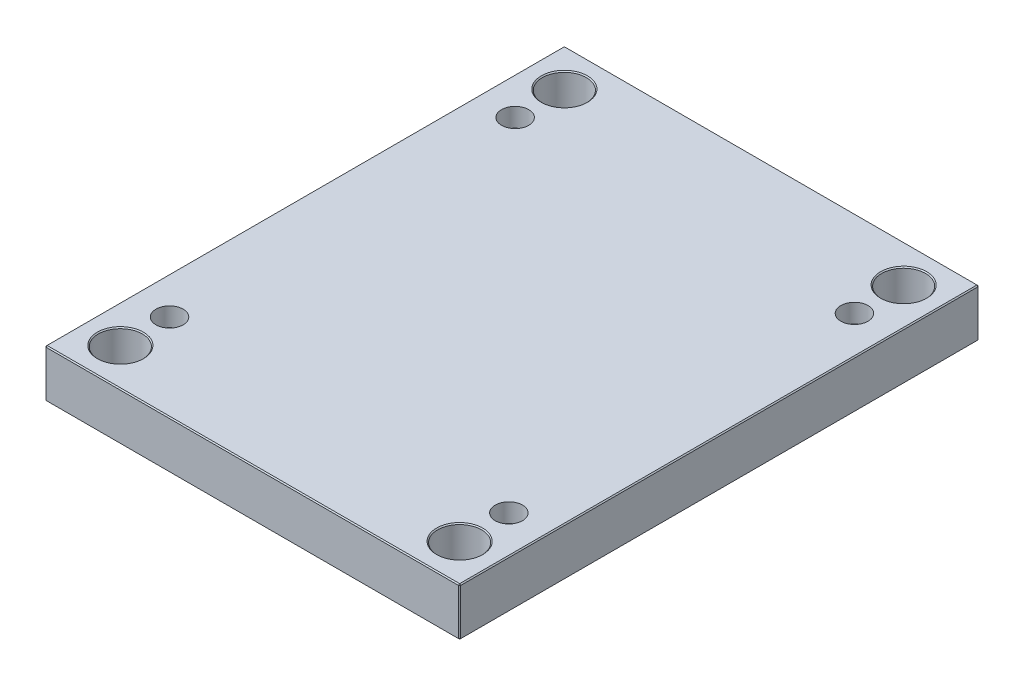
ISO-10303-21;
HEADER;
FILE_DESCRIPTION(('STEP AP214'),'2;1');
FILE_NAME('part.step','',(''),(''),'','','');
FILE_SCHEMA(('AUTOMOTIVE_DESIGN { 1 0 10303 214 1 1 1 1 }'));
ENDSEC;
DATA;
#1=APPLICATION_CONTEXT('core data for automotive mechanical design processes');
#2=APPLICATION_PROTOCOL_DEFINITION('international standard','automotive_design',2000,#1);
#3=PRODUCT_CONTEXT('',#1,'mechanical');
#4=PRODUCT('Part','Part','',(#3));
#5=PRODUCT_RELATED_PRODUCT_CATEGORY('part','',(#4));
#6=PRODUCT_DEFINITION_FORMATION('','',#4);
#7=PRODUCT_DEFINITION_CONTEXT('part definition',#1,'design');
#8=PRODUCT_DEFINITION('design','',#6,#7);
#9=PRODUCT_DEFINITION_SHAPE('','',#8);
#10=(LENGTH_UNIT() NAMED_UNIT(*) SI_UNIT(.MILLI.,.METRE.));
#11=(NAMED_UNIT(*) PLANE_ANGLE_UNIT() SI_UNIT($,.RADIAN.));
#12=(NAMED_UNIT(*) SI_UNIT($,.STERADIAN.) SOLID_ANGLE_UNIT());
#13=UNCERTAINTY_MEASURE_WITH_UNIT(LENGTH_MEASURE(1.E-05),#10,'distance_accuracy_value','');
#14=(GEOMETRIC_REPRESENTATION_CONTEXT(3) GLOBAL_UNCERTAINTY_ASSIGNED_CONTEXT((#13)) GLOBAL_UNIT_ASSIGNED_CONTEXT((#10,
#11,#12)) REPRESENTATION_CONTEXT('',''));
#15=CARTESIAN_POINT('',(0.,0.,0.));
#16=DIRECTION('',(0.,0.,1.));
#17=DIRECTION('',(1.,0.,0.));
#18=AXIS2_PLACEMENT_3D('',#15,#16,#17);
#19=CARTESIAN_POINT('',(-162.,0.,-165.));
#20=DIRECTION('',(0.,1.,0.));
#21=DIRECTION('',(0.,0.,1.));
#22=AXIS2_PLACEMENT_3D('',#19,#20,#21);
#23=CYLINDRICAL_SURFACE('',#22,8.);
#24=CARTESIAN_POINT('',(-162.,0.,-165.));
#25=DIRECTION('',(0.,1.,0.));
#26=DIRECTION('',(0.,0.,1.));
#27=AXIS2_PLACEMENT_3D('',#24,#25,#26);
#28=CIRCLE('',#27,8.);
#29=CARTESIAN_POINT('',(-162.,0.,-157.));
#30=VERTEX_POINT('',#29);
#31=EDGE_CURVE('E150',#30,#30,#28,.T.);
#32=ORIENTED_EDGE('',*,*,#31,.F.);
#33=EDGE_LOOP('',(#32));
#34=FACE_BOUND('',#33,.T.);
#35=CARTESIAN_POINT('',(-162.,28.,-165.));
#36=DIRECTION('',(0.,1.,0.));
#37=DIRECTION('',(0.,0.,1.));
#38=AXIS2_PLACEMENT_3D('',#35,#36,#37);
#39=CIRCLE('',#38,8.);
#40=CARTESIAN_POINT('',(-162.,28.,-157.));
#41=VERTEX_POINT('',#40);
#42=EDGE_CURVE('E20',#41,#41,#39,.F.);
#43=ORIENTED_EDGE('',*,*,#42,.F.);
#44=EDGE_LOOP('',(#43));
#45=FACE_BOUND('',#44,.T.);
#46=ADVANCED_FACE('F16',(#34,#45),#23,.F.);
#47=CARTESIAN_POINT('',(162.,0.,-165.));
#48=DIRECTION('',(0.,1.,0.));
#49=DIRECTION('',(0.,0.,1.));
#50=AXIS2_PLACEMENT_3D('',#47,#48,#49);
#51=CYLINDRICAL_SURFACE('',#50,8.);
#52=CARTESIAN_POINT('',(162.,0.,-165.));
#53=DIRECTION('',(0.,1.,0.));
#54=DIRECTION('',(0.,0.,1.));
#55=AXIS2_PLACEMENT_3D('',#52,#53,#54);
#56=CIRCLE('',#55,8.);
#57=CARTESIAN_POINT('',(162.,0.,-157.));
#58=VERTEX_POINT('',#57);
#59=EDGE_CURVE('E307',#58,#58,#56,.T.);
#60=ORIENTED_EDGE('',*,*,#59,.F.);
#61=EDGE_LOOP('',(#60));
#62=FACE_BOUND('',#61,.T.);
#63=CARTESIAN_POINT('',(162.,28.,-165.));
#64=DIRECTION('',(0.,1.,0.));
#65=DIRECTION('',(0.,0.,1.));
#66=AXIS2_PLACEMENT_3D('',#63,#64,#65);
#67=CIRCLE('',#66,8.);
#68=CARTESIAN_POINT('',(162.,28.,-157.));
#69=VERTEX_POINT('',#68);
#70=EDGE_CURVE('E294',#69,#69,#67,.F.);
#71=ORIENTED_EDGE('',*,*,#70,.F.);
#72=EDGE_LOOP('',(#71));
#73=FACE_BOUND('',#72,.T.);
#74=ADVANCED_FACE('F473',(#62,#73),#51,.F.);
#75=CARTESIAN_POINT('',(162.,0.,165.));
#76=DIRECTION('',(0.,1.,0.));
#77=DIRECTION('',(0.,0.,1.));
#78=AXIS2_PLACEMENT_3D('',#75,#76,#77);
#79=CYLINDRICAL_SURFACE('',#78,8.);
#80=CARTESIAN_POINT('',(162.,0.,165.));
#81=DIRECTION('',(0.,1.,0.));
#82=DIRECTION('',(0.,0.,1.));
#83=AXIS2_PLACEMENT_3D('',#80,#81,#82);
#84=CIRCLE('',#83,8.);
#85=CARTESIAN_POINT('',(162.,0.,173.));
#86=VERTEX_POINT('',#85);
#87=EDGE_CURVE('E303',#86,#86,#84,.T.);
#88=ORIENTED_EDGE('',*,*,#87,.F.);
#89=EDGE_LOOP('',(#88));
#90=FACE_BOUND('',#89,.T.);
#91=CARTESIAN_POINT('',(162.,28.,165.));
#92=DIRECTION('',(0.,1.,0.));
#93=DIRECTION('',(0.,0.,1.));
#94=AXIS2_PLACEMENT_3D('',#91,#92,#93);
#95=CIRCLE('',#94,8.);
#96=CARTESIAN_POINT('',(162.,28.,173.));
#97=VERTEX_POINT('',#96);
#98=EDGE_CURVE('E291',#97,#97,#95,.F.);
#99=ORIENTED_EDGE('',*,*,#98,.F.);
#100=EDGE_LOOP('',(#99));
#101=FACE_BOUND('',#100,.T.);
#102=ADVANCED_FACE('F480',(#90,#101),#79,.F.);
#103=CARTESIAN_POINT('',(-162.,0.,165.));
#104=DIRECTION('',(0.,1.,0.));
#105=DIRECTION('',(0.,0.,1.));
#106=AXIS2_PLACEMENT_3D('',#103,#104,#105);
#107=CYLINDRICAL_SURFACE('',#106,8.);
#108=CARTESIAN_POINT('',(-162.,0.,165.));
#109=DIRECTION('',(0.,1.,0.));
#110=DIRECTION('',(0.,0.,1.));
#111=AXIS2_PLACEMENT_3D('',#108,#109,#110);
#112=CIRCLE('',#111,8.);
#113=CARTESIAN_POINT('',(-162.,0.,173.));
#114=VERTEX_POINT('',#113);
#115=EDGE_CURVE('E299',#114,#114,#112,.T.);
#116=ORIENTED_EDGE('',*,*,#115,.F.);
#117=EDGE_LOOP('',(#116));
#118=FACE_BOUND('',#117,.T.);
#119=CARTESIAN_POINT('',(-162.,28.,165.));
#120=DIRECTION('',(0.,1.,0.));
#121=DIRECTION('',(0.,0.,1.));
#122=AXIS2_PLACEMENT_3D('',#119,#120,#121);
#123=CIRCLE('',#122,8.);
#124=CARTESIAN_POINT('',(-162.,28.,173.));
#125=VERTEX_POINT('',#124);
#126=EDGE_CURVE('E288',#125,#125,#123,.F.);
#127=ORIENTED_EDGE('',*,*,#126,.F.);
#128=EDGE_LOOP('',(#127));
#129=FACE_BOUND('',#128,.T.);
#130=ADVANCED_FACE('F485',(#118,#129),#107,.F.);
#131=CARTESIAN_POINT('',(-198.,46.,248.));
#132=DIRECTION('',(1.,0.,0.));
#133=DIRECTION('',(0.,0.,-1.));
#134=AXIS2_PLACEMENT_3D('',#131,#132,#133);
#135=PLANE('',#134);
#136=DIRECTION('',(0.,-1.,0.));
#137=VECTOR('',#136,1.);
#138=CARTESIAN_POINT('',(-198.,46.,-247.));
#139=LINE('',#138,#137);
#140=CARTESIAN_POINT('',(-198.,45.,-247.));
#141=VERTEX_POINT('',#140);
#142=CARTESIAN_POINT('',(-198.,1.,-247.));
#143=VERTEX_POINT('',#142);
#144=EDGE_CURVE('E118',#141,#143,#139,.T.);
#145=ORIENTED_EDGE('',*,*,#144,.T.);
#146=DIRECTION('',(0.,0.,1.));
#147=VECTOR('',#146,1.);
#148=CARTESIAN_POINT('',(-198.,1.,248.));
#149=LINE('',#148,#147);
#150=CARTESIAN_POINT('',(-198.,1.,247.));
#151=VERTEX_POINT('',#150);
#152=EDGE_CURVE('E114',#143,#151,#149,.T.);
#153=ORIENTED_EDGE('',*,*,#152,.T.);
#154=DIRECTION('',(0.,1.,0.));
#155=VECTOR('',#154,1.);
#156=CARTESIAN_POINT('',(-198.,46.,247.));
#157=LINE('',#156,#155);
#158=CARTESIAN_POINT('',(-198.,45.,247.));
#159=VERTEX_POINT('',#158);
#160=EDGE_CURVE('E106',#151,#159,#157,.T.);
#161=ORIENTED_EDGE('',*,*,#160,.T.);
#162=DIRECTION('',(0.,0.,-1.));
#163=VECTOR('',#162,1.);
#164=CARTESIAN_POINT('',(-198.,45.,-248.));
#165=LINE('',#164,#163);
#166=EDGE_CURVE('E111',#159,#141,#165,.T.);
#167=ORIENTED_EDGE('',*,*,#166,.T.);
#168=EDGE_LOOP('',(#145,#153,#161,#167));
#169=FACE_BOUND('',#168,.T.);
#170=ADVANCED_FACE('F109',(#169),#135,.F.);
#171=CARTESIAN_POINT('',(198.,46.,248.));
#172=DIRECTION('',(0.,0.,-1.));
#173=DIRECTION('',(-1.,0.,0.));
#174=AXIS2_PLACEMENT_3D('',#171,#172,#173);
#175=PLANE('',#174);
#176=DIRECTION('',(-1.,0.,0.));
#177=VECTOR('',#176,1.);
#178=CARTESIAN_POINT('',(-198.,45.,248.));
#179=LINE('',#178,#177);
#180=CARTESIAN_POINT('',(197.,45.,248.));
#181=VERTEX_POINT('',#180);
#182=CARTESIAN_POINT('',(-197.,45.,248.));
#183=VERTEX_POINT('',#182);
#184=EDGE_CURVE('E173',#181,#183,#179,.T.);
#185=ORIENTED_EDGE('',*,*,#184,.T.);
#186=DIRECTION('',(0.,-1.,0.));
#187=VECTOR('',#186,1.);
#188=CARTESIAN_POINT('',(-197.,46.,248.));
#189=LINE('',#188,#187);
#190=CARTESIAN_POINT('',(-197.,1.,248.));
#191=VERTEX_POINT('',#190);
#192=EDGE_CURVE('E126',#183,#191,#189,.T.);
#193=ORIENTED_EDGE('',*,*,#192,.T.);
#194=DIRECTION('',(1.,0.,0.));
#195=VECTOR('',#194,1.);
#196=CARTESIAN_POINT('',(198.,1.,248.));
#197=LINE('',#196,#195);
#198=CARTESIAN_POINT('',(197.,1.,248.));
#199=VERTEX_POINT('',#198);
#200=EDGE_CURVE('E177',#191,#199,#197,.T.);
#201=ORIENTED_EDGE('',*,*,#200,.T.);
#202=DIRECTION('',(0.,1.,0.));
#203=VECTOR('',#202,1.);
#204=CARTESIAN_POINT('',(197.,46.,248.));
#205=LINE('',#204,#203);
#206=EDGE_CURVE('E175',#199,#181,#205,.T.);
#207=ORIENTED_EDGE('',*,*,#206,.T.);
#208=EDGE_LOOP('',(#185,#193,#201,#207));
#209=FACE_BOUND('',#208,.T.);
#210=ADVANCED_FACE('F438',(#209),#175,.F.);
#211=CARTESIAN_POINT('',(198.,46.,248.));
#212=DIRECTION('',(-1.,0.,0.));
#213=DIRECTION('',(0.,0.,1.));
#214=AXIS2_PLACEMENT_3D('',#211,#212,#213);
#215=PLANE('',#214);
#216=DIRECTION('',(0.,0.,-1.));
#217=VECTOR('',#216,1.);
#218=CARTESIAN_POINT('',(198.,1.,248.));
#219=LINE('',#218,#217);
#220=CARTESIAN_POINT('',(198.,1.,247.));
#221=VERTEX_POINT('',#220);
#222=CARTESIAN_POINT('',(198.,1.,-247.));
#223=VERTEX_POINT('',#222);
#224=EDGE_CURVE('E168',#221,#223,#219,.T.);
#225=ORIENTED_EDGE('',*,*,#224,.T.);
#226=DIRECTION('',(0.,1.,0.));
#227=VECTOR('',#226,1.);
#228=CARTESIAN_POINT('',(198.,46.,-247.));
#229=LINE('',#228,#227);
#230=CARTESIAN_POINT('',(198.,45.,-247.));
#231=VERTEX_POINT('',#230);
#232=EDGE_CURVE('E170',#223,#231,#229,.T.);
#233=ORIENTED_EDGE('',*,*,#232,.T.);
#234=DIRECTION('',(0.,0.,1.));
#235=VECTOR('',#234,1.);
#236=CARTESIAN_POINT('',(198.,45.,248.));
#237=LINE('',#236,#235);
#238=CARTESIAN_POINT('',(198.,45.,247.));
#239=VERTEX_POINT('',#238);
#240=EDGE_CURVE('E164',#231,#239,#237,.T.);
#241=ORIENTED_EDGE('',*,*,#240,.T.);
#242=DIRECTION('',(0.,-1.,0.));
#243=VECTOR('',#242,1.);
#244=CARTESIAN_POINT('',(198.,46.,247.));
#245=LINE('',#244,#243);
#246=EDGE_CURVE('E166',#239,#221,#245,.T.);
#247=ORIENTED_EDGE('',*,*,#246,.T.);
#248=EDGE_LOOP('',(#225,#233,#241,#247));
#249=FACE_BOUND('',#248,.T.);
#250=ADVANCED_FACE('F431',(#249),#215,.F.);
#251=CARTESIAN_POINT('',(198.,46.,-248.));
#252=DIRECTION('',(0.,0.,1.));
#253=DIRECTION('',(1.,0.,0.));
#254=AXIS2_PLACEMENT_3D('',#251,#252,#253);
#255=PLANE('',#254);
#256=DIRECTION('',(0.,-1.,0.));
#257=VECTOR('',#256,1.);
#258=CARTESIAN_POINT('',(197.,46.,-248.));
#259=LINE('',#258,#257);
#260=CARTESIAN_POINT('',(197.,45.,-248.));
#261=VERTEX_POINT('',#260);
#262=CARTESIAN_POINT('',(197.,1.,-248.));
#263=VERTEX_POINT('',#262);
#264=EDGE_CURVE('E157',#261,#263,#259,.T.);
#265=ORIENTED_EDGE('',*,*,#264,.T.);
#266=DIRECTION('',(-1.,0.,0.));
#267=VECTOR('',#266,1.);
#268=CARTESIAN_POINT('',(198.,1.,-248.));
#269=LINE('',#268,#267);
#270=CARTESIAN_POINT('',(-197.,1.,-248.));
#271=VERTEX_POINT('',#270);
#272=EDGE_CURVE('E162',#263,#271,#269,.T.);
#273=ORIENTED_EDGE('',*,*,#272,.T.);
#274=DIRECTION('',(0.,1.,0.));
#275=VECTOR('',#274,1.);
#276=CARTESIAN_POINT('',(-197.,46.,-248.));
#277=LINE('',#276,#275);
#278=CARTESIAN_POINT('',(-197.,45.,-248.));
#279=VERTEX_POINT('',#278);
#280=EDGE_CURVE('E159',#271,#279,#277,.T.);
#281=ORIENTED_EDGE('',*,*,#280,.T.);
#282=DIRECTION('',(1.,0.,0.));
#283=VECTOR('',#282,1.);
#284=CARTESIAN_POINT('',(198.,45.,-248.));
#285=LINE('',#284,#283);
#286=EDGE_CURVE('E155',#279,#261,#285,.T.);
#287=ORIENTED_EDGE('',*,*,#286,.T.);
#288=EDGE_LOOP('',(#265,#273,#281,#287));
#289=FACE_BOUND('',#288,.T.);
#290=ADVANCED_FACE('F349',(#289),#255,.F.);
#291=CARTESIAN_POINT('',(0.,46.,0.));
#292=DIRECTION('',(0.,1.,0.));
#293=DIRECTION('',(0.,0.,1.));
#294=AXIS2_PLACEMENT_3D('',#291,#292,#293);
#295=PLANE('',#294);
#296=CARTESIAN_POINT('',(-162.,46.,165.));
#297=DIRECTION('',(0.,1.,0.));
#298=DIRECTION('',(0.,0.,1.));
#299=AXIS2_PLACEMENT_3D('',#296,#297,#298);
#300=CIRCLE('',#299,13.);
#301=CARTESIAN_POINT('',(-162.,46.,178.));
#302=VERTEX_POINT('',#301);
#303=EDGE_CURVE('E318',#302,#302,#300,.T.);
#304=ORIENTED_EDGE('',*,*,#303,.F.);
#305=EDGE_LOOP('',(#304));
#306=FACE_BOUND('',#305,.T.);
#307=CARTESIAN_POINT('',(162.,46.,165.));
#308=DIRECTION('',(0.,1.,0.));
#309=DIRECTION('',(0.,0.,1.));
#310=AXIS2_PLACEMENT_3D('',#307,#308,#309);
#311=CIRCLE('',#310,13.);
#312=CARTESIAN_POINT('',(162.,46.,178.));
#313=VERTEX_POINT('',#312);
#314=EDGE_CURVE('E324',#313,#313,#311,.T.);
#315=ORIENTED_EDGE('',*,*,#314,.F.);
#316=EDGE_LOOP('',(#315));
#317=FACE_BOUND('',#316,.T.);
#318=CARTESIAN_POINT('',(162.,46.,-165.));
#319=DIRECTION('',(0.,1.,0.));
#320=DIRECTION('',(0.,0.,1.));
#321=AXIS2_PLACEMENT_3D('',#318,#319,#320);
#322=CIRCLE('',#321,13.);
#323=CARTESIAN_POINT('',(162.,46.,-152.));
#324=VERTEX_POINT('',#323);
#325=EDGE_CURVE('E330',#324,#324,#322,.T.);
#326=ORIENTED_EDGE('',*,*,#325,.F.);
#327=EDGE_LOOP('',(#326));
#328=FACE_BOUND('',#327,.T.);
#329=CARTESIAN_POINT('',(-162.,46.,-165.));
#330=DIRECTION('',(0.,1.,0.));
#331=DIRECTION('',(0.,0.,1.));
#332=AXIS2_PLACEMENT_3D('',#329,#330,#331);
#333=CIRCLE('',#332,13.);
#334=CARTESIAN_POINT('',(-162.,46.,-152.));
#335=VERTEX_POINT('',#334);
#336=EDGE_CURVE('E312',#335,#335,#333,.T.);
#337=ORIENTED_EDGE('',*,*,#336,.F.);
#338=EDGE_LOOP('',(#337));
#339=FACE_BOUND('',#338,.T.);
#340=CARTESIAN_POINT('',(-162.,46.,212.));
#341=DIRECTION('',(0.,1.,0.));
#342=DIRECTION('',(0.,0.,1.));
#343=AXIS2_PLACEMENT_3D('',#340,#341,#342);
#344=CIRCLE('',#343,22.);
#345=CARTESIAN_POINT('',(-162.,46.,234.));
#346=VERTEX_POINT('',#345);
#347=EDGE_CURVE('E259',#346,#346,#344,.F.);
#348=ORIENTED_EDGE('',*,*,#347,.T.);
#349=EDGE_LOOP('',(#348));
#350=FACE_BOUND('',#349,.T.);
#351=CARTESIAN_POINT('',(162.,46.,212.));
#352=DIRECTION('',(0.,1.,0.));
#353=DIRECTION('',(0.,0.,1.));
#354=AXIS2_PLACEMENT_3D('',#351,#352,#353);
#355=CIRCLE('',#354,22.);
#356=CARTESIAN_POINT('',(162.,46.,234.));
#357=VERTEX_POINT('',#356);
#358=EDGE_CURVE('E256',#357,#357,#355,.F.);
#359=ORIENTED_EDGE('',*,*,#358,.T.);
#360=EDGE_LOOP('',(#359));
#361=FACE_BOUND('',#360,.T.);
#362=CARTESIAN_POINT('',(162.,46.,-212.));
#363=DIRECTION('',(0.,1.,0.));
#364=DIRECTION('',(0.,0.,1.));
#365=AXIS2_PLACEMENT_3D('',#362,#363,#364);
#366=CIRCLE('',#365,22.);
#367=CARTESIAN_POINT('',(162.,46.,-190.));
#368=VERTEX_POINT('',#367);
#369=EDGE_CURVE('E253',#368,#368,#366,.F.);
#370=ORIENTED_EDGE('',*,*,#369,.T.);
#371=EDGE_LOOP('',(#370));
#372=FACE_BOUND('',#371,.T.);
#373=CARTESIAN_POINT('',(-162.,46.,-212.));
#374=DIRECTION('',(0.,1.,0.));
#375=DIRECTION('',(0.,0.,1.));
#376=AXIS2_PLACEMENT_3D('',#373,#374,#375);
#377=CIRCLE('',#376,22.);
#378=CARTESIAN_POINT('',(-162.,46.,-190.));
#379=VERTEX_POINT('',#378);
#380=EDGE_CURVE('E250',#379,#379,#377,.F.);
#381=ORIENTED_EDGE('',*,*,#380,.T.);
#382=EDGE_LOOP('',(#381));
#383=FACE_BOUND('',#382,.T.);
#384=DIRECTION('',(0.,0.,-1.));
#385=VECTOR('',#384,1.);
#386=CARTESIAN_POINT('',(197.,46.,-248.));
#387=LINE('',#386,#385);
#388=CARTESIAN_POINT('',(197.,46.,247.));
#389=VERTEX_POINT('',#388);
#390=CARTESIAN_POINT('',(197.,46.,-247.));
#391=VERTEX_POINT('',#390);
#392=EDGE_CURVE('E33',#389,#391,#387,.T.);
#393=ORIENTED_EDGE('',*,*,#392,.T.);
#394=DIRECTION('',(-1.,0.,0.));
#395=VECTOR('',#394,1.);
#396=CARTESIAN_POINT('',(-198.,46.,-247.));
#397=LINE('',#396,#395);
#398=CARTESIAN_POINT('',(-197.,46.,-247.));
#399=VERTEX_POINT('',#398);
#400=EDGE_CURVE('E193',#391,#399,#397,.T.);
#401=ORIENTED_EDGE('',*,*,#400,.T.);
#402=DIRECTION('',(0.,0.,1.));
#403=VECTOR('',#402,1.);
#404=CARTESIAN_POINT('',(-197.,46.,248.));
#405=LINE('',#404,#403);
#406=CARTESIAN_POINT('',(-197.,46.,247.));
#407=VERTEX_POINT('',#406);
#408=EDGE_CURVE('E189',#399,#407,#405,.T.);
#409=ORIENTED_EDGE('',*,*,#408,.T.);
#410=DIRECTION('',(1.,0.,0.));
#411=VECTOR('',#410,1.);
#412=CARTESIAN_POINT('',(198.,46.,247.));
#413=LINE('',#412,#411);
#414=EDGE_CURVE('E38',#407,#389,#413,.T.);
#415=ORIENTED_EDGE('',*,*,#414,.T.);
#416=EDGE_LOOP('',(#393,#401,#409,#415));
#417=FACE_BOUND('',#416,.T.);
#418=ADVANCED_FACE('F345',(#306,#317,#328,#339,#350,#361,#372,#383,#417),#295,.T.);
#419=CARTESIAN_POINT('',(0.,0.,0.));
#420=DIRECTION('',(0.,1.,0.));
#421=DIRECTION('',(0.,0.,1.));
#422=AXIS2_PLACEMENT_3D('',#419,#420,#421);
#423=PLANE('',#422);
#424=CARTESIAN_POINT('',(-162.,0.,212.));
#425=DIRECTION('',(0.,1.,0.));
#426=DIRECTION('',(0.,0.,1.));
#427=AXIS2_PLACEMENT_3D('',#424,#425,#426);
#428=CIRCLE('',#427,22.);
#429=CARTESIAN_POINT('',(-162.,0.,234.));
#430=VERTEX_POINT('',#429);
#431=EDGE_CURVE('E271',#430,#430,#428,.T.);
#432=ORIENTED_EDGE('',*,*,#431,.T.);
#433=EDGE_LOOP('',(#432));
#434=FACE_BOUND('',#433,.T.);
#435=CARTESIAN_POINT('',(162.,0.,212.));
#436=DIRECTION('',(0.,1.,0.));
#437=DIRECTION('',(0.,0.,1.));
#438=AXIS2_PLACEMENT_3D('',#435,#436,#437);
#439=CIRCLE('',#438,22.);
#440=CARTESIAN_POINT('',(162.,0.,234.));
#441=VERTEX_POINT('',#440);
#442=EDGE_CURVE('E268',#441,#441,#439,.T.);
#443=ORIENTED_EDGE('',*,*,#442,.T.);
#444=EDGE_LOOP('',(#443));
#445=FACE_BOUND('',#444,.T.);
#446=CARTESIAN_POINT('',(162.,0.,-212.));
#447=DIRECTION('',(0.,1.,0.));
#448=DIRECTION('',(0.,0.,1.));
#449=AXIS2_PLACEMENT_3D('',#446,#447,#448);
#450=CIRCLE('',#449,22.);
#451=CARTESIAN_POINT('',(162.,0.,-190.));
#452=VERTEX_POINT('',#451);
#453=EDGE_CURVE('E265',#452,#452,#450,.T.);
#454=ORIENTED_EDGE('',*,*,#453,.T.);
#455=EDGE_LOOP('',(#454));
#456=FACE_BOUND('',#455,.T.);
#457=CARTESIAN_POINT('',(-162.,0.,-212.));
#458=DIRECTION('',(0.,1.,0.));
#459=DIRECTION('',(0.,0.,1.));
#460=AXIS2_PLACEMENT_3D('',#457,#458,#459);
#461=CIRCLE('',#460,22.);
#462=CARTESIAN_POINT('',(-162.,0.,-190.));
#463=VERTEX_POINT('',#462);
#464=EDGE_CURVE('E262',#463,#463,#461,.T.);
#465=ORIENTED_EDGE('',*,*,#464,.T.);
#466=EDGE_LOOP('',(#465));
#467=FACE_BOUND('',#466,.T.);
#468=ORIENTED_EDGE('',*,*,#115,.T.);
#469=EDGE_LOOP('',(#468));
#470=FACE_BOUND('',#469,.T.);
#471=ORIENTED_EDGE('',*,*,#87,.T.);
#472=EDGE_LOOP('',(#471));
#473=FACE_BOUND('',#472,.T.);
#474=ORIENTED_EDGE('',*,*,#59,.T.);
#475=EDGE_LOOP('',(#474));
#476=FACE_BOUND('',#475,.T.);
#477=ORIENTED_EDGE('',*,*,#31,.T.);
#478=EDGE_LOOP('',(#477));
#479=FACE_BOUND('',#478,.T.);
#480=DIRECTION('',(0.,0.,1.));
#481=VECTOR('',#480,1.);
#482=CARTESIAN_POINT('',(197.,0.,0.));
#483=LINE('',#482,#481);
#484=CARTESIAN_POINT('',(197.,0.,-247.));
#485=VERTEX_POINT('',#484);
#486=CARTESIAN_POINT('',(197.,0.,247.));
#487=VERTEX_POINT('',#486);
#488=EDGE_CURVE('E180',#485,#487,#483,.T.);
#489=ORIENTED_EDGE('',*,*,#488,.T.);
#490=DIRECTION('',(-1.,0.,0.));
#491=VECTOR('',#490,1.);
#492=CARTESIAN_POINT('',(0.,0.,247.));
#493=LINE('',#492,#491);
#494=CARTESIAN_POINT('',(-197.,0.,247.));
#495=VERTEX_POINT('',#494);
#496=EDGE_CURVE('E186',#487,#495,#493,.T.);
#497=ORIENTED_EDGE('',*,*,#496,.T.);
#498=DIRECTION('',(0.,0.,-1.));
#499=VECTOR('',#498,1.);
#500=CARTESIAN_POINT('',(-197.,0.,0.));
#501=LINE('',#500,#499);
#502=CARTESIAN_POINT('',(-197.,0.,-247.));
#503=VERTEX_POINT('',#502);
#504=EDGE_CURVE('E184',#495,#503,#501,.T.);
#505=ORIENTED_EDGE('',*,*,#504,.T.);
#506=DIRECTION('',(1.,0.,0.));
#507=VECTOR('',#506,1.);
#508=CARTESIAN_POINT('',(0.,0.,-247.));
#509=LINE('',#508,#507);
#510=EDGE_CURVE('E182',#503,#485,#509,.T.);
#511=ORIENTED_EDGE('',*,*,#510,.T.);
#512=EDGE_LOOP('',(#489,#497,#505,#511));
#513=FACE_BOUND('',#512,.T.);
#514=ADVANCED_FACE('F348',(#434,#445,#456,#467,#470,#473,#476,#479,#513),#423,.F.);
#515=CARTESIAN_POINT('',(198.,46.,247.));
#516=DIRECTION('',(-0.707106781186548,0.,-0.707106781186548));
#517=DIRECTION('',(0.,-1.,0.));
#518=AXIS2_PLACEMENT_3D('',#515,#516,#517);
#519=PLANE('',#518);
#520=DIRECTION('',(-0.707106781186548,0.,0.707106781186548));
#521=VECTOR('',#520,1.);
#522=CARTESIAN_POINT('',(197.,45.,248.));
#523=LINE('',#522,#521);
#524=EDGE_CURVE('E144',#181,#239,#523,.F.);
#525=ORIENTED_EDGE('',*,*,#524,.F.);
#526=ORIENTED_EDGE('',*,*,#206,.F.);
#527=DIRECTION('',(0.707106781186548,0.,-0.707106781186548));
#528=VECTOR('',#527,1.);
#529=CARTESIAN_POINT('',(197.,1.,248.));
#530=LINE('',#529,#528);
#531=EDGE_CURVE('E147',#221,#199,#530,.F.);
#532=ORIENTED_EDGE('',*,*,#531,.F.);
#533=ORIENTED_EDGE('',*,*,#246,.F.);
#534=EDGE_LOOP('',(#525,#526,#532,#533));
#535=FACE_BOUND('',#534,.T.);
#536=ADVANCED_FACE('F382',(#535),#519,.F.);
#537=CARTESIAN_POINT('',(197.,45.,248.));
#538=DIRECTION('',(0.577350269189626,0.577350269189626,0.577350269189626));
#539=DIRECTION('',(0.707106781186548,0.,-0.707106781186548));
#540=AXIS2_PLACEMENT_3D('',#537,#538,#539);
#541=PLANE('',#540);
#542=DIRECTION('',(0.,-0.707106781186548,0.707106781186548));
#543=VECTOR('',#542,1.);
#544=CARTESIAN_POINT('',(197.,45.,248.));
#545=LINE('',#544,#543);
#546=EDGE_CURVE('E238',#181,#389,#545,.F.);
#547=ORIENTED_EDGE('',*,*,#546,.F.);
#548=ORIENTED_EDGE('',*,*,#524,.T.);
#549=DIRECTION('',(-0.707106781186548,0.707106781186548,0.));
#550=VECTOR('',#549,1.);
#551=CARTESIAN_POINT('',(197.5,45.5,247.));
#552=LINE('',#551,#550);
#553=EDGE_CURVE('E240',#389,#239,#552,.F.);
#554=ORIENTED_EDGE('',*,*,#553,.F.);
#555=EDGE_LOOP('',(#547,#548,#554));
#556=FACE_BOUND('',#555,.T.);
#557=ADVANCED_FACE('F444',(#556),#541,.T.);
#558=CARTESIAN_POINT('',(197.,1.,248.));
#559=DIRECTION('',(0.577350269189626,-0.577350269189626,0.577350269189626));
#560=DIRECTION('',(0.707106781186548,0.,-0.707106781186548));
#561=AXIS2_PLACEMENT_3D('',#558,#559,#560);
#562=PLANE('',#561);
#563=DIRECTION('',(-0.707106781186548,-0.707106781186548,0.));
#564=VECTOR('',#563,1.);
#565=CARTESIAN_POINT('',(197.5,0.5,247.));
#566=LINE('',#565,#564);
#567=EDGE_CURVE('E232',#221,#487,#566,.T.);
#568=ORIENTED_EDGE('',*,*,#567,.F.);
#569=ORIENTED_EDGE('',*,*,#531,.T.);
#570=DIRECTION('',(0.,0.707106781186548,0.707106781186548));
#571=VECTOR('',#570,1.);
#572=CARTESIAN_POINT('',(197.,1.,248.));
#573=LINE('',#572,#571);
#574=EDGE_CURVE('E235',#487,#199,#573,.T.);
#575=ORIENTED_EDGE('',*,*,#574,.F.);
#576=EDGE_LOOP('',(#568,#569,#575));
#577=FACE_BOUND('',#576,.T.);
#578=ADVANCED_FACE('F403',(#577),#562,.T.);
#579=CARTESIAN_POINT('',(197.,46.,0.));
#580=DIRECTION('',(0.707106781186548,0.707106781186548,0.));
#581=DIRECTION('',(0.,0.,1.));
#582=AXIS2_PLACEMENT_3D('',#579,#580,#581);
#583=PLANE('',#582);
#584=ORIENTED_EDGE('',*,*,#553,.T.);
#585=ORIENTED_EDGE('',*,*,#240,.F.);
#586=DIRECTION('',(0.707106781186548,-0.707106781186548,0.));
#587=VECTOR('',#586,1.);
#588=CARTESIAN_POINT('',(198.,45.,-247.));
#589=LINE('',#588,#587);
#590=EDGE_CURVE('E227',#391,#231,#589,.T.);
#591=ORIENTED_EDGE('',*,*,#590,.F.);
#592=ORIENTED_EDGE('',*,*,#392,.F.);
#593=EDGE_LOOP('',(#584,#585,#591,#592));
#594=FACE_BOUND('',#593,.T.);
#595=ADVANCED_FACE('F446',(#594),#583,.T.);
#596=CARTESIAN_POINT('',(0.,46.,247.));
#597=DIRECTION('',(0.,0.707106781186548,0.707106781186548));
#598=DIRECTION('',(-1.,0.,0.));
#599=AXIS2_PLACEMENT_3D('',#596,#597,#598);
#600=PLANE('',#599);
#601=ORIENTED_EDGE('',*,*,#546,.T.);
#602=ORIENTED_EDGE('',*,*,#414,.F.);
#603=DIRECTION('',(0.,0.707106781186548,-0.707106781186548));
#604=VECTOR('',#603,1.);
#605=CARTESIAN_POINT('',(-197.,45.5,247.5));
#606=LINE('',#605,#604);
#607=EDGE_CURVE('E130',#183,#407,#606,.T.);
#608=ORIENTED_EDGE('',*,*,#607,.F.);
#609=ORIENTED_EDGE('',*,*,#184,.F.);
#610=EDGE_LOOP('',(#601,#602,#608,#609));
#611=FACE_BOUND('',#610,.T.);
#612=ADVANCED_FACE('F441',(#611),#600,.T.);
#613=CARTESIAN_POINT('',(-197.,46.,248.));
#614=DIRECTION('',(0.707106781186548,0.,-0.707106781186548));
#615=DIRECTION('',(0.,-1.,0.));
#616=AXIS2_PLACEMENT_3D('',#613,#614,#615);
#617=PLANE('',#616);
#618=DIRECTION('',(0.707106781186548,0.,0.707106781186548));
#619=VECTOR('',#618,1.);
#620=CARTESIAN_POINT('',(-197.,1.,248.));
#621=LINE('',#620,#619);
#622=EDGE_CURVE('E131',#191,#151,#621,.F.);
#623=ORIENTED_EDGE('',*,*,#622,.F.);
#624=ORIENTED_EDGE('',*,*,#192,.F.);
#625=DIRECTION('',(-0.707106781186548,0.,-0.707106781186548));
#626=VECTOR('',#625,1.);
#627=CARTESIAN_POINT('',(-198.,45.,247.));
#628=LINE('',#627,#626);
#629=EDGE_CURVE('E122',#159,#183,#628,.F.);
#630=ORIENTED_EDGE('',*,*,#629,.F.);
#631=ORIENTED_EDGE('',*,*,#160,.F.);
#632=EDGE_LOOP('',(#623,#624,#630,#631));
#633=FACE_BOUND('',#632,.T.);
#634=ADVANCED_FACE('F124',(#633),#617,.F.);
#635=CARTESIAN_POINT('',(198.,1.,248.));
#636=DIRECTION('',(0.,0.707106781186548,-0.707106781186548));
#637=DIRECTION('',(1.,0.,0.));
#638=AXIS2_PLACEMENT_3D('',#635,#636,#637);
#639=PLANE('',#638);
#640=ORIENTED_EDGE('',*,*,#574,.T.);
#641=ORIENTED_EDGE('',*,*,#200,.F.);
#642=DIRECTION('',(0.,-0.707106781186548,-0.707106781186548));
#643=VECTOR('',#642,1.);
#644=CARTESIAN_POINT('',(-197.,1.,248.));
#645=LINE('',#644,#643);
#646=EDGE_CURVE('E223',#495,#191,#645,.F.);
#647=ORIENTED_EDGE('',*,*,#646,.F.);
#648=ORIENTED_EDGE('',*,*,#496,.F.);
#649=EDGE_LOOP('',(#640,#641,#647,#648));
#650=FACE_BOUND('',#649,.T.);
#651=ADVANCED_FACE('F408',(#650),#639,.F.);
#652=CARTESIAN_POINT('',(198.,1.,248.));
#653=DIRECTION('',(-0.707106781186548,0.707106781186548,0.));
#654=DIRECTION('',(0.,0.,-1.));
#655=AXIS2_PLACEMENT_3D('',#652,#653,#654);
#656=PLANE('',#655);
#657=ORIENTED_EDGE('',*,*,#567,.T.);
#658=ORIENTED_EDGE('',*,*,#488,.F.);
#659=DIRECTION('',(0.707106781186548,0.707106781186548,0.));
#660=VECTOR('',#659,1.);
#661=CARTESIAN_POINT('',(197.5,0.500000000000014,-247.));
#662=LINE('',#661,#660);
#663=EDGE_CURVE('E220',#223,#485,#662,.F.);
#664=ORIENTED_EDGE('',*,*,#663,.F.);
#665=ORIENTED_EDGE('',*,*,#224,.F.);
#666=EDGE_LOOP('',(#657,#658,#664,#665));
#667=FACE_BOUND('',#666,.T.);
#668=ADVANCED_FACE('F401',(#667),#656,.F.);
#669=CARTESIAN_POINT('',(197.,46.,-248.));
#670=DIRECTION('',(-0.707106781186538,0.,0.707106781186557));
#671=DIRECTION('',(0.,-1.,0.));
#672=AXIS2_PLACEMENT_3D('',#669,#670,#671);
#673=PLANE('',#672);
#674=DIRECTION('',(0.707106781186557,0.,0.707106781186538));
#675=VECTOR('',#674,1.);
#676=CARTESIAN_POINT('',(198.,45.,-247.));
#677=LINE('',#676,#675);
#678=EDGE_CURVE('E229',#231,#261,#677,.F.);
#679=ORIENTED_EDGE('',*,*,#678,.F.);
#680=ORIENTED_EDGE('',*,*,#232,.F.);
#681=DIRECTION('',(-0.707106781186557,0.,-0.707106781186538));
#682=VECTOR('',#681,1.);
#683=CARTESIAN_POINT('',(197.,1.,-248.));
#684=LINE('',#683,#682);
#685=EDGE_CURVE('E217',#263,#223,#684,.F.);
#686=ORIENTED_EDGE('',*,*,#685,.F.);
#687=ORIENTED_EDGE('',*,*,#264,.F.);
#688=EDGE_LOOP('',(#679,#680,#686,#687));
#689=FACE_BOUND('',#688,.T.);
#690=ADVANCED_FACE('F428',(#689),#673,.F.);
#691=CARTESIAN_POINT('',(198.,45.,-247.));
#692=DIRECTION('',(0.577350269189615,0.577350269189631,-0.577350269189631));
#693=DIRECTION('',(0.,0.707106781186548,0.707106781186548));
#694=AXIS2_PLACEMENT_3D('',#691,#692,#693);
#695=PLANE('',#694);
#696=ORIENTED_EDGE('',*,*,#590,.T.);
#697=ORIENTED_EDGE('',*,*,#678,.T.);
#698=DIRECTION('',(0.,0.707106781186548,0.707106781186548));
#699=VECTOR('',#698,1.);
#700=CARTESIAN_POINT('',(197.,45.5,-247.5));
#701=LINE('',#700,#699);
#702=EDGE_CURVE('E138',#391,#261,#701,.F.);
#703=ORIENTED_EDGE('',*,*,#702,.F.);
#704=EDGE_LOOP('',(#696,#697,#703));
#705=FACE_BOUND('',#704,.T.);
#706=ADVANCED_FACE('F450',(#705),#695,.T.);
#707=CARTESIAN_POINT('',(-198.,45.,247.));
#708=DIRECTION('',(-0.577350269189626,0.577350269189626,0.577350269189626));
#709=DIRECTION('',(0.707106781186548,0.,0.707106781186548));
#710=AXIS2_PLACEMENT_3D('',#707,#708,#709);
#711=PLANE('',#710);
#712=ORIENTED_EDGE('',*,*,#629,.T.);
#713=ORIENTED_EDGE('',*,*,#607,.T.);
#714=DIRECTION('',(-0.707106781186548,-0.707106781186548,0.));
#715=VECTOR('',#714,1.);
#716=CARTESIAN_POINT('',(-198.,45.,247.));
#717=LINE('',#716,#715);
#718=EDGE_CURVE('E134',#159,#407,#717,.F.);
#719=ORIENTED_EDGE('',*,*,#718,.F.);
#720=EDGE_LOOP('',(#712,#713,#719));
#721=FACE_BOUND('',#720,.T.);
#722=ADVANCED_FACE('F135',(#721),#711,.T.);
#723=CARTESIAN_POINT('',(-197.,1.,248.));
#724=DIRECTION('',(-0.577350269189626,-0.577350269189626,0.577350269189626));
#725=DIRECTION('',(0.707106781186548,0.,0.707106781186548));
#726=AXIS2_PLACEMENT_3D('',#723,#724,#725);
#727=PLANE('',#726);
#728=ORIENTED_EDGE('',*,*,#646,.T.);
#729=ORIENTED_EDGE('',*,*,#622,.T.);
#730=DIRECTION('',(-0.707106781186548,0.707106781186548,0.));
#731=VECTOR('',#730,1.);
#732=CARTESIAN_POINT('',(-197.5,0.5,247.));
#733=LINE('',#732,#731);
#734=EDGE_CURVE('E139',#495,#151,#733,.T.);
#735=ORIENTED_EDGE('',*,*,#734,.F.);
#736=EDGE_LOOP('',(#728,#729,#735));
#737=FACE_BOUND('',#736,.T.);
#738=ADVANCED_FACE('F411',(#737),#727,.T.);
#739=CARTESIAN_POINT('',(197.,1.,-248.));
#740=DIRECTION('',(0.577350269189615,-0.577350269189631,-0.577350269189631));
#741=DIRECTION('',(0.,0.707106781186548,-0.707106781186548));
#742=AXIS2_PLACEMENT_3D('',#739,#740,#741);
#743=PLANE('',#742);
#744=ORIENTED_EDGE('',*,*,#685,.T.);
#745=ORIENTED_EDGE('',*,*,#663,.T.);
#746=DIRECTION('',(0.,-0.707106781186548,0.707106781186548));
#747=VECTOR('',#746,1.);
#748=CARTESIAN_POINT('',(197.,1.,-248.));
#749=LINE('',#748,#747);
#750=EDGE_CURVE('E210',#263,#485,#749,.T.);
#751=ORIENTED_EDGE('',*,*,#750,.F.);
#752=EDGE_LOOP('',(#744,#745,#751));
#753=FACE_BOUND('',#752,.T.);
#754=ADVANCED_FACE('F422',(#753),#743,.T.);
#755=CARTESIAN_POINT('',(0.,46.,-247.));
#756=DIRECTION('',(0.,0.707106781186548,-0.707106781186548));
#757=DIRECTION('',(1.,0.,0.));
#758=AXIS2_PLACEMENT_3D('',#755,#756,#757);
#759=PLANE('',#758);
#760=ORIENTED_EDGE('',*,*,#702,.T.);
#761=ORIENTED_EDGE('',*,*,#286,.F.);
#762=DIRECTION('',(0.,-0.707106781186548,-0.707106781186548));
#763=VECTOR('',#762,1.);
#764=CARTESIAN_POINT('',(-197.,45.,-248.));
#765=LINE('',#764,#763);
#766=EDGE_CURVE('E207',#399,#279,#765,.T.);
#767=ORIENTED_EDGE('',*,*,#766,.F.);
#768=ORIENTED_EDGE('',*,*,#400,.F.);
#769=EDGE_LOOP('',(#760,#761,#767,#768));
#770=FACE_BOUND('',#769,.T.);
#771=ADVANCED_FACE('F454',(#770),#759,.T.);
#772=CARTESIAN_POINT('',(-197.,46.,0.));
#773=DIRECTION('',(-0.707106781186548,0.707106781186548,0.));
#774=DIRECTION('',(0.,0.,-1.));
#775=AXIS2_PLACEMENT_3D('',#772,#773,#774);
#776=PLANE('',#775);
#777=ORIENTED_EDGE('',*,*,#718,.T.);
#778=ORIENTED_EDGE('',*,*,#408,.F.);
#779=DIRECTION('',(0.707106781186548,0.707106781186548,0.));
#780=VECTOR('',#779,1.);
#781=CARTESIAN_POINT('',(-197.5,45.5,-247.));
#782=LINE('',#781,#780);
#783=EDGE_CURVE('E142',#141,#399,#782,.T.);
#784=ORIENTED_EDGE('',*,*,#783,.F.);
#785=ORIENTED_EDGE('',*,*,#166,.F.);
#786=EDGE_LOOP('',(#777,#778,#784,#785));
#787=FACE_BOUND('',#786,.T.);
#788=ADVANCED_FACE('F141',(#787),#776,.T.);
#789=CARTESIAN_POINT('',(-198.,1.,248.));
#790=DIRECTION('',(0.707106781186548,0.707106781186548,0.));
#791=DIRECTION('',(0.,0.,1.));
#792=AXIS2_PLACEMENT_3D('',#789,#790,#791);
#793=PLANE('',#792);
#794=ORIENTED_EDGE('',*,*,#734,.T.);
#795=ORIENTED_EDGE('',*,*,#152,.F.);
#796=DIRECTION('',(0.707106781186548,-0.707106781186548,0.));
#797=VECTOR('',#796,1.);
#798=CARTESIAN_POINT('',(-198.,1.,-247.));
#799=LINE('',#798,#797);
#800=EDGE_CURVE('E203',#503,#143,#799,.F.);
#801=ORIENTED_EDGE('',*,*,#800,.F.);
#802=ORIENTED_EDGE('',*,*,#504,.F.);
#803=EDGE_LOOP('',(#794,#795,#801,#802));
#804=FACE_BOUND('',#803,.T.);
#805=ADVANCED_FACE('F413',(#804),#793,.F.);
#806=CARTESIAN_POINT('',(198.,1.,-248.));
#807=DIRECTION('',(0.,0.707106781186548,0.707106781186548));
#808=DIRECTION('',(-1.,0.,0.));
#809=AXIS2_PLACEMENT_3D('',#806,#807,#808);
#810=PLANE('',#809);
#811=ORIENTED_EDGE('',*,*,#750,.T.);
#812=ORIENTED_EDGE('',*,*,#510,.F.);
#813=DIRECTION('',(0.,0.707106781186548,-0.707106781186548));
#814=VECTOR('',#813,1.);
#815=CARTESIAN_POINT('',(-197.,0.499999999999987,-247.5));
#816=LINE('',#815,#814);
#817=EDGE_CURVE('E200',#271,#503,#816,.F.);
#818=ORIENTED_EDGE('',*,*,#817,.F.);
#819=ORIENTED_EDGE('',*,*,#272,.F.);
#820=EDGE_LOOP('',(#811,#812,#818,#819));
#821=FACE_BOUND('',#820,.T.);
#822=ADVANCED_FACE('F417',(#821),#810,.F.);
#823=CARTESIAN_POINT('',(-197.,45.,-248.));
#824=DIRECTION('',(-0.577350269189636,0.57735026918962,-0.57735026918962));
#825=DIRECTION('',(-0.707106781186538,0.,0.707106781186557));
#826=AXIS2_PLACEMENT_3D('',#823,#824,#825);
#827=PLANE('',#826);
#828=ORIENTED_EDGE('',*,*,#783,.T.);
#829=ORIENTED_EDGE('',*,*,#766,.T.);
#830=DIRECTION('',(0.707106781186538,0.,-0.707106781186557));
#831=VECTOR('',#830,1.);
#832=CARTESIAN_POINT('',(-197.,45.,-248.));
#833=LINE('',#832,#831);
#834=EDGE_CURVE('E198',#141,#279,#833,.T.);
#835=ORIENTED_EDGE('',*,*,#834,.F.);
#836=EDGE_LOOP('',(#828,#829,#835));
#837=FACE_BOUND('',#836,.T.);
#838=ADVANCED_FACE('F456',(#837),#827,.T.);
#839=CARTESIAN_POINT('',(-198.,1.,-247.));
#840=DIRECTION('',(-0.577350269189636,-0.57735026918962,-0.57735026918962));
#841=DIRECTION('',(-0.707106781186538,0.,0.707106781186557));
#842=AXIS2_PLACEMENT_3D('',#839,#840,#841);
#843=PLANE('',#842);
#844=ORIENTED_EDGE('',*,*,#817,.T.);
#845=ORIENTED_EDGE('',*,*,#800,.T.);
#846=DIRECTION('',(-0.707106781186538,0.,0.707106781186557));
#847=VECTOR('',#846,1.);
#848=CARTESIAN_POINT('',(-198.,1.,-247.));
#849=LINE('',#848,#847);
#850=EDGE_CURVE('E196',#271,#143,#849,.T.);
#851=ORIENTED_EDGE('',*,*,#850,.F.);
#852=EDGE_LOOP('',(#844,#845,#851));
#853=FACE_BOUND('',#852,.T.);
#854=ADVANCED_FACE('F461',(#853),#843,.T.);
#855=CARTESIAN_POINT('',(-198.,46.,-247.));
#856=DIRECTION('',(0.707106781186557,0.,0.707106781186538));
#857=DIRECTION('',(0.,-1.,0.));
#858=AXIS2_PLACEMENT_3D('',#855,#856,#857);
#859=PLANE('',#858);
#860=ORIENTED_EDGE('',*,*,#834,.T.);
#861=ORIENTED_EDGE('',*,*,#280,.F.);
#862=ORIENTED_EDGE('',*,*,#850,.T.);
#863=ORIENTED_EDGE('',*,*,#144,.F.);
#864=EDGE_LOOP('',(#860,#861,#862,#863));
#865=FACE_BOUND('',#864,.T.);
#866=ADVANCED_FACE('F372',(#865),#859,.F.);
#867=CARTESIAN_POINT('',(-162.,0.,-212.));
#868=DIRECTION('',(0.,1.,0.));
#869=DIRECTION('',(0.,0.,1.));
#870=AXIS2_PLACEMENT_3D('',#867,#868,#869);
#871=CYLINDRICAL_SURFACE('',#870,21.);
#872=CARTESIAN_POINT('',(-162.,45.,-212.));
#873=DIRECTION('',(0.,1.,0.));
#874=DIRECTION('',(0.,0.,1.));
#875=AXIS2_PLACEMENT_3D('',#872,#873,#874);
#876=CIRCLE('',#875,21.);
#877=CARTESIAN_POINT('',(-162.,45.,-191.));
#878=VERTEX_POINT('',#877);
#879=EDGE_CURVE('E10',#878,#878,#876,.T.);
#880=ORIENTED_EDGE('',*,*,#879,.T.);
#881=EDGE_LOOP('',(#880));
#882=FACE_BOUND('',#881,.T.);
#883=CARTESIAN_POINT('',(-162.,0.999999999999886,-212.));
#884=DIRECTION('',(0.,1.,0.));
#885=DIRECTION('',(0.,0.,1.));
#886=AXIS2_PLACEMENT_3D('',#883,#884,#885);
#887=CIRCLE('',#886,21.);
#888=CARTESIAN_POINT('',(-162.,0.999999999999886,-191.));
#889=VERTEX_POINT('',#888);
#890=EDGE_CURVE('E25',#889,#889,#887,.F.);
#891=ORIENTED_EDGE('',*,*,#890,.T.);
#892=EDGE_LOOP('',(#891));
#893=FACE_BOUND('',#892,.T.);
#894=ADVANCED_FACE('F368',(#882,#893),#871,.F.);
#895=CARTESIAN_POINT('',(162.,0.,-212.));
#896=DIRECTION('',(0.,1.,0.));
#897=DIRECTION('',(0.,0.,1.));
#898=AXIS2_PLACEMENT_3D('',#895,#896,#897);
#899=CYLINDRICAL_SURFACE('',#898,21.);
#900=CARTESIAN_POINT('',(162.,45.,-212.));
#901=DIRECTION('',(0.,1.,0.));
#902=DIRECTION('',(0.,0.,1.));
#903=AXIS2_PLACEMENT_3D('',#900,#901,#902);
#904=CIRCLE('',#903,21.);
#905=CARTESIAN_POINT('',(162.,45.,-191.));
#906=VERTEX_POINT('',#905);
#907=EDGE_CURVE('E283',#906,#906,#904,.T.);
#908=ORIENTED_EDGE('',*,*,#907,.T.);
#909=EDGE_LOOP('',(#908));
#910=FACE_BOUND('',#909,.T.);
#911=CARTESIAN_POINT('',(162.,0.999999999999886,-212.));
#912=DIRECTION('',(0.,1.,0.));
#913=DIRECTION('',(0.,0.,1.));
#914=AXIS2_PLACEMENT_3D('',#911,#912,#913);
#915=CIRCLE('',#914,21.);
#916=CARTESIAN_POINT('',(162.,0.999999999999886,-191.));
#917=VERTEX_POINT('',#916);
#918=EDGE_CURVE('E280',#917,#917,#915,.F.);
#919=ORIENTED_EDGE('',*,*,#918,.T.);
#920=EDGE_LOOP('',(#919));
#921=FACE_BOUND('',#920,.T.);
#922=ADVANCED_FACE('F371',(#910,#921),#899,.F.);
#923=CARTESIAN_POINT('',(162.,0.,212.));
#924=DIRECTION('',(0.,1.,0.));
#925=DIRECTION('',(0.,0.,1.));
#926=AXIS2_PLACEMENT_3D('',#923,#924,#925);
#927=CYLINDRICAL_SURFACE('',#926,21.);
#928=CARTESIAN_POINT('',(162.,45.,212.));
#929=DIRECTION('',(0.,1.,0.));
#930=DIRECTION('',(0.,0.,1.));
#931=AXIS2_PLACEMENT_3D('',#928,#929,#930);
#932=CIRCLE('',#931,21.);
#933=CARTESIAN_POINT('',(162.,45.,233.));
#934=VERTEX_POINT('',#933);
#935=EDGE_CURVE('E277',#934,#934,#932,.T.);
#936=ORIENTED_EDGE('',*,*,#935,.T.);
#937=EDGE_LOOP('',(#936));
#938=FACE_BOUND('',#937,.T.);
#939=CARTESIAN_POINT('',(162.,0.999999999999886,212.));
#940=DIRECTION('',(0.,1.,0.));
#941=DIRECTION('',(0.,0.,1.));
#942=AXIS2_PLACEMENT_3D('',#939,#940,#941);
#943=CIRCLE('',#942,21.);
#944=CARTESIAN_POINT('',(162.,0.999999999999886,233.));
#945=VERTEX_POINT('',#944);
#946=EDGE_CURVE('E274',#945,#945,#943,.F.);
#947=ORIENTED_EDGE('',*,*,#946,.T.);
#948=EDGE_LOOP('',(#947));
#949=FACE_BOUND('',#948,.T.);
#950=ADVANCED_FACE('F533',(#938,#949),#927,.F.);
#951=CARTESIAN_POINT('',(-162.,0.,212.));
#952=DIRECTION('',(0.,1.,0.));
#953=DIRECTION('',(0.,0.,1.));
#954=AXIS2_PLACEMENT_3D('',#951,#952,#953);
#955=CYLINDRICAL_SURFACE('',#954,21.);
#956=CARTESIAN_POINT('',(-162.,45.,212.));
#957=DIRECTION('',(0.,1.,0.));
#958=DIRECTION('',(0.,0.,1.));
#959=AXIS2_PLACEMENT_3D('',#956,#957,#958);
#960=CIRCLE('',#959,21.);
#961=CARTESIAN_POINT('',(-162.,45.,233.));
#962=VERTEX_POINT('',#961);
#963=EDGE_CURVE('E247',#962,#962,#960,.T.);
#964=ORIENTED_EDGE('',*,*,#963,.T.);
#965=EDGE_LOOP('',(#964));
#966=FACE_BOUND('',#965,.T.);
#967=CARTESIAN_POINT('',(-162.,0.999999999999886,212.));
#968=DIRECTION('',(0.,1.,0.));
#969=DIRECTION('',(0.,0.,1.));
#970=AXIS2_PLACEMENT_3D('',#967,#968,#969);
#971=CIRCLE('',#970,21.);
#972=CARTESIAN_POINT('',(-162.,0.999999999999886,233.));
#973=VERTEX_POINT('',#972);
#974=EDGE_CURVE('E195',#973,#973,#971,.F.);
#975=ORIENTED_EDGE('',*,*,#974,.T.);
#976=EDGE_LOOP('',(#975));
#977=FACE_BOUND('',#976,.T.);
#978=ADVANCED_FACE('F537',(#966,#977),#955,.F.);
#979=CARTESIAN_POINT('',(-162.,45.,212.));
#980=DIRECTION('',(0.,1.,0.));
#981=DIRECTION('',(0.,0.,1.));
#982=AXIS2_PLACEMENT_3D('',#979,#980,#981);
#983=CONICAL_SURFACE('',#982,21.,0.785398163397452);
#984=ORIENTED_EDGE('',*,*,#347,.F.);
#985=EDGE_LOOP('',(#984));
#986=FACE_BOUND('',#985,.T.);
#987=ORIENTED_EDGE('',*,*,#963,.F.);
#988=EDGE_LOOP('',(#987));
#989=FACE_BOUND('',#988,.T.);
#990=ADVANCED_FACE('F540',(#986,#989),#983,.F.);
#991=CARTESIAN_POINT('',(-162.,0.,212.));
#992=DIRECTION('',(0.,-1.,0.));
#993=DIRECTION('',(0.,0.,-1.));
#994=AXIS2_PLACEMENT_3D('',#991,#992,#993);
#995=CONICAL_SURFACE('',#994,22.,0.785398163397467);
#996=ORIENTED_EDGE('',*,*,#974,.F.);
#997=EDGE_LOOP('',(#996));
#998=FACE_BOUND('',#997,.T.);
#999=ORIENTED_EDGE('',*,*,#431,.F.);
#1000=EDGE_LOOP('',(#999));
#1001=FACE_BOUND('',#1000,.T.);
#1002=ADVANCED_FACE('F546',(#998,#1001),#995,.F.);
#1003=CARTESIAN_POINT('',(162.,45.,212.));
#1004=DIRECTION('',(0.,1.,0.));
#1005=DIRECTION('',(0.,0.,1.));
#1006=AXIS2_PLACEMENT_3D('',#1003,#1004,#1005);
#1007=CONICAL_SURFACE('',#1006,21.,0.785398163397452);
#1008=ORIENTED_EDGE('',*,*,#358,.F.);
#1009=EDGE_LOOP('',(#1008));
#1010=FACE_BOUND('',#1009,.T.);
#1011=ORIENTED_EDGE('',*,*,#935,.F.);
#1012=EDGE_LOOP('',(#1011));
#1013=FACE_BOUND('',#1012,.T.);
#1014=ADVANCED_FACE('F555',(#1010,#1013),#1007,.F.);
#1015=CARTESIAN_POINT('',(162.,0.,212.));
#1016=DIRECTION('',(0.,-1.,0.));
#1017=DIRECTION('',(0.,0.,-1.));
#1018=AXIS2_PLACEMENT_3D('',#1015,#1016,#1017);
#1019=CONICAL_SURFACE('',#1018,22.,0.785398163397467);
#1020=ORIENTED_EDGE('',*,*,#946,.F.);
#1021=EDGE_LOOP('',(#1020));
#1022=FACE_BOUND('',#1021,.T.);
#1023=ORIENTED_EDGE('',*,*,#442,.F.);
#1024=EDGE_LOOP('',(#1023));
#1025=FACE_BOUND('',#1024,.T.);
#1026=ADVANCED_FACE('F571',(#1022,#1025),#1019,.F.);
#1027=CARTESIAN_POINT('',(162.,45.,-212.));
#1028=DIRECTION('',(0.,1.,0.));
#1029=DIRECTION('',(0.,0.,1.));
#1030=AXIS2_PLACEMENT_3D('',#1027,#1028,#1029);
#1031=CONICAL_SURFACE('',#1030,21.,0.785398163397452);
#1032=ORIENTED_EDGE('',*,*,#369,.F.);
#1033=EDGE_LOOP('',(#1032));
#1034=FACE_BOUND('',#1033,.T.);
#1035=ORIENTED_EDGE('',*,*,#907,.F.);
#1036=EDGE_LOOP('',(#1035));
#1037=FACE_BOUND('',#1036,.T.);
#1038=ADVANCED_FACE('F564',(#1034,#1037),#1031,.F.);
#1039=CARTESIAN_POINT('',(162.,0.,-212.));
#1040=DIRECTION('',(0.,-1.,0.));
#1041=DIRECTION('',(0.,0.,-1.));
#1042=AXIS2_PLACEMENT_3D('',#1039,#1040,#1041);
#1043=CONICAL_SURFACE('',#1042,22.,0.785398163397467);
#1044=ORIENTED_EDGE('',*,*,#918,.F.);
#1045=EDGE_LOOP('',(#1044));
#1046=FACE_BOUND('',#1045,.T.);
#1047=ORIENTED_EDGE('',*,*,#453,.F.);
#1048=EDGE_LOOP('',(#1047));
#1049=FACE_BOUND('',#1048,.T.);
#1050=ADVANCED_FACE('F365',(#1046,#1049),#1043,.F.);
#1051=CARTESIAN_POINT('',(-162.,45.,-212.));
#1052=DIRECTION('',(0.,1.,0.));
#1053=DIRECTION('',(0.,0.,1.));
#1054=AXIS2_PLACEMENT_3D('',#1051,#1052,#1053);
#1055=CONICAL_SURFACE('',#1054,21.,0.785398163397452);
#1056=ORIENTED_EDGE('',*,*,#380,.F.);
#1057=EDGE_LOOP('',(#1056));
#1058=FACE_BOUND('',#1057,.T.);
#1059=ORIENTED_EDGE('',*,*,#879,.F.);
#1060=EDGE_LOOP('',(#1059));
#1061=FACE_BOUND('',#1060,.T.);
#1062=ADVANCED_FACE('F362',(#1058,#1061),#1055,.F.);
#1063=CARTESIAN_POINT('',(-162.,0.,-212.));
#1064=DIRECTION('',(0.,-1.,0.));
#1065=DIRECTION('',(0.,0.,-1.));
#1066=AXIS2_PLACEMENT_3D('',#1063,#1064,#1065);
#1067=CONICAL_SURFACE('',#1066,22.,0.785398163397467);
#1068=ORIENTED_EDGE('',*,*,#890,.F.);
#1069=EDGE_LOOP('',(#1068));
#1070=FACE_BOUND('',#1069,.T.);
#1071=ORIENTED_EDGE('',*,*,#464,.F.);
#1072=EDGE_LOOP('',(#1071));
#1073=FACE_BOUND('',#1072,.T.);
#1074=ADVANCED_FACE('F18',(#1070,#1073),#1067,.F.);
#1075=CARTESIAN_POINT('',(-162.,28.,165.));
#1076=DIRECTION('',(0.,1.,0.));
#1077=DIRECTION('',(0.,0.,1.));
#1078=AXIS2_PLACEMENT_3D('',#1075,#1076,#1077);
#1079=PLANE('',#1078);
#1080=CARTESIAN_POINT('',(-162.,28.,165.));
#1081=DIRECTION('',(0.,1.,0.));
#1082=DIRECTION('',(0.,0.,1.));
#1083=AXIS2_PLACEMENT_3D('',#1080,#1081,#1082);
#1084=CIRCLE('',#1083,13.);
#1085=CARTESIAN_POINT('',(-162.,28.,178.));
#1086=VERTEX_POINT('',#1085);
#1087=EDGE_CURVE('E321',#1086,#1086,#1084,.T.);
#1088=ORIENTED_EDGE('',*,*,#1087,.T.);
#1089=EDGE_LOOP('',(#1088));
#1090=FACE_BOUND('',#1089,.T.);
#1091=ORIENTED_EDGE('',*,*,#126,.T.);
#1092=EDGE_LOOP('',(#1091));
#1093=FACE_BOUND('',#1092,.T.);
#1094=ADVANCED_FACE('F378',(#1090,#1093),#1079,.T.);
#1095=CARTESIAN_POINT('',(-162.,28.,165.));
#1096=DIRECTION('',(0.,1.,0.));
#1097=DIRECTION('',(0.,0.,1.));
#1098=AXIS2_PLACEMENT_3D('',#1095,#1096,#1097);
#1099=CYLINDRICAL_SURFACE('',#1098,13.);
#1100=ORIENTED_EDGE('',*,*,#1087,.F.);
#1101=EDGE_LOOP('',(#1100));
#1102=FACE_BOUND('',#1101,.T.);
#1103=ORIENTED_EDGE('',*,*,#303,.T.);
#1104=EDGE_LOOP('',(#1103));
#1105=FACE_BOUND('',#1104,.T.);
#1106=ADVANCED_FACE('F510',(#1102,#1105),#1099,.F.);
#1107=CARTESIAN_POINT('',(162.,28.,165.));
#1108=DIRECTION('',(0.,1.,0.));
#1109=DIRECTION('',(0.,0.,1.));
#1110=AXIS2_PLACEMENT_3D('',#1107,#1108,#1109);
#1111=PLANE('',#1110);
#1112=CARTESIAN_POINT('',(162.,28.,165.));
#1113=DIRECTION('',(0.,1.,0.));
#1114=DIRECTION('',(0.,0.,1.));
#1115=AXIS2_PLACEMENT_3D('',#1112,#1113,#1114);
#1116=CIRCLE('',#1115,13.);
#1117=CARTESIAN_POINT('',(162.,28.,178.));
#1118=VERTEX_POINT('',#1117);
#1119=EDGE_CURVE('E327',#1118,#1118,#1116,.T.);
#1120=ORIENTED_EDGE('',*,*,#1119,.T.);
#1121=EDGE_LOOP('',(#1120));
#1122=FACE_BOUND('',#1121,.T.);
#1123=ORIENTED_EDGE('',*,*,#98,.T.);
#1124=EDGE_LOOP('',(#1123));
#1125=FACE_BOUND('',#1124,.T.);
#1126=ADVANCED_FACE('F517',(#1122,#1125),#1111,.T.);
#1127=CARTESIAN_POINT('',(162.,28.,165.));
#1128=DIRECTION('',(0.,1.,0.));
#1129=DIRECTION('',(0.,0.,1.));
#1130=AXIS2_PLACEMENT_3D('',#1127,#1128,#1129);
#1131=CYLINDRICAL_SURFACE('',#1130,13.);
#1132=ORIENTED_EDGE('',*,*,#1119,.F.);
#1133=EDGE_LOOP('',(#1132));
#1134=FACE_BOUND('',#1133,.T.);
#1135=ORIENTED_EDGE('',*,*,#314,.T.);
#1136=EDGE_LOOP('',(#1135));
#1137=FACE_BOUND('',#1136,.T.);
#1138=ADVANCED_FACE('F521',(#1134,#1137),#1131,.F.);
#1139=CARTESIAN_POINT('',(162.,28.,-165.));
#1140=DIRECTION('',(0.,1.,0.));
#1141=DIRECTION('',(0.,0.,1.));
#1142=AXIS2_PLACEMENT_3D('',#1139,#1140,#1141);
#1143=PLANE('',#1142);
#1144=CARTESIAN_POINT('',(162.,28.,-165.));
#1145=DIRECTION('',(0.,1.,0.));
#1146=DIRECTION('',(0.,0.,1.));
#1147=AXIS2_PLACEMENT_3D('',#1144,#1145,#1146);
#1148=CIRCLE('',#1147,13.);
#1149=CARTESIAN_POINT('',(162.,28.,-152.));
#1150=VERTEX_POINT('',#1149);
#1151=EDGE_CURVE('E315',#1150,#1150,#1148,.T.);
#1152=ORIENTED_EDGE('',*,*,#1151,.T.);
#1153=EDGE_LOOP('',(#1152));
#1154=FACE_BOUND('',#1153,.T.);
#1155=ORIENTED_EDGE('',*,*,#70,.T.);
#1156=EDGE_LOOP('',(#1155));
#1157=FACE_BOUND('',#1156,.T.);
#1158=ADVANCED_FACE('F336',(#1154,#1157),#1143,.T.);
#1159=CARTESIAN_POINT('',(162.,28.,-165.));
#1160=DIRECTION('',(0.,1.,0.));
#1161=DIRECTION('',(0.,0.,1.));
#1162=AXIS2_PLACEMENT_3D('',#1159,#1160,#1161);
#1163=CYLINDRICAL_SURFACE('',#1162,13.);
#1164=ORIENTED_EDGE('',*,*,#1151,.F.);
#1165=EDGE_LOOP('',(#1164));
#1166=FACE_BOUND('',#1165,.T.);
#1167=ORIENTED_EDGE('',*,*,#325,.T.);
#1168=EDGE_LOOP('',(#1167));
#1169=FACE_BOUND('',#1168,.T.);
#1170=ADVANCED_FACE('F338',(#1166,#1169),#1163,.F.);
#1171=CARTESIAN_POINT('',(-162.,28.,-165.));
#1172=DIRECTION('',(0.,1.,0.));
#1173=DIRECTION('',(0.,0.,1.));
#1174=AXIS2_PLACEMENT_3D('',#1171,#1172,#1173);
#1175=PLANE('',#1174);
#1176=CARTESIAN_POINT('',(-162.,28.,-165.));
#1177=DIRECTION('',(0.,1.,0.));
#1178=DIRECTION('',(0.,0.,1.));
#1179=AXIS2_PLACEMENT_3D('',#1176,#1177,#1178);
#1180=CIRCLE('',#1179,13.);
#1181=CARTESIAN_POINT('',(-162.,28.,-152.));
#1182=VERTEX_POINT('',#1181);
#1183=EDGE_CURVE('E292',#1182,#1182,#1180,.T.);
#1184=ORIENTED_EDGE('',*,*,#1183,.T.);
#1185=EDGE_LOOP('',(#1184));
#1186=FACE_BOUND('',#1185,.T.);
#1187=ORIENTED_EDGE('',*,*,#42,.T.);
#1188=EDGE_LOOP('',(#1187));
#1189=FACE_BOUND('',#1188,.T.);
#1190=ADVANCED_FACE('F341',(#1186,#1189),#1175,.T.);
#1191=CARTESIAN_POINT('',(-162.,28.,-165.));
#1192=DIRECTION('',(0.,1.,0.));
#1193=DIRECTION('',(0.,0.,1.));
#1194=AXIS2_PLACEMENT_3D('',#1191,#1192,#1193);
#1195=CYLINDRICAL_SURFACE('',#1194,13.);
#1196=ORIENTED_EDGE('',*,*,#1183,.F.);
#1197=EDGE_LOOP('',(#1196));
#1198=FACE_BOUND('',#1197,.T.);
#1199=ORIENTED_EDGE('',*,*,#336,.T.);
#1200=EDGE_LOOP('',(#1199));
#1201=FACE_BOUND('',#1200,.T.);
#1202=ADVANCED_FACE('F526',(#1198,#1201),#1195,.F.);
#1203=CLOSED_SHELL('',(#46,#74,#102,#130,#170,#210,#250,#290,#418,#514,#536,#557,#578,#595,#612,
#634,#651,#668,#690,#706,#722,#738,#754,#771,#788,#805,#822,#838,#854,#866,#894,#922,#950,#978,
#990,#1002,#1014,#1026,#1038,#1050,#1062,#1074,#1094,#1106,#1126,#1138,#1158,#1170,#1190,#1202));
#1204=MANIFOLD_SOLID_BREP('B1',#1203);
#1205=ADVANCED_BREP_SHAPE_REPRESENTATION('',(#18,#1204),#14);
#1206=SHAPE_DEFINITION_REPRESENTATION(#9,#1205);
ENDSEC;
END-ISO-10303-21;
